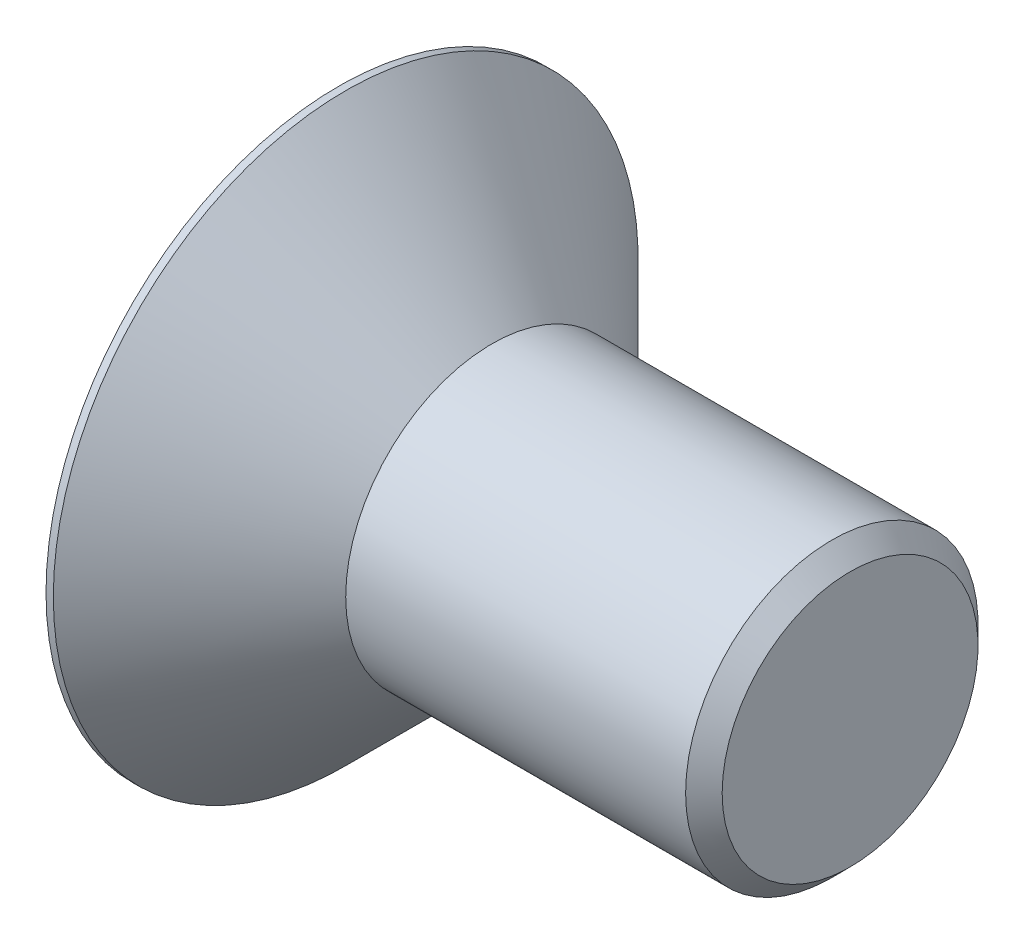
from build123d import *

# Parameters (mm, degrees)
FASE1_SIZE                      = 0.5
SCHNITT_LINEAR_AUSTRAGEN1_DEPTH = 2.5


with BuildPart() as part:
    # Skizze1 → Rotation1 (revolve)
    with BuildSketch(Plane.XY, mode=Mode.PRIVATE) as rotation1_sk:
        Polygon((0, 0), (0, 8), (0.2, 8), (4.2, 4), (14, 4), (14, 0), align=None)
    revolve(rotation1_sk.sketch.rotate(Axis((0, 0, 0), (1, 0, 0)), 90), axis=Axis((0, 0, 0), (1, 0, 0)))

    # Fase1
    fase1_edges = [part.edges().sort_by_distance(p)[0] for p in [
        (14, 0, -4),
    ]]
    chamfer(fase1_edges, length=FASE1_SIZE)

    # Skizze2 → Schnitt-Linear austragen1 (cut)
    with BuildSketch(Plane.ZY):
        Polygon((2.3377107, 1.693647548), (-0.297886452, 2.871340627), (-2.635597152, 1.177693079), (-2.3377107, -1.693647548), (0.297886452, -2.871340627), (2.635597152, -1.177693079), align=None)
    extrude(amount=-SCHNITT_LINEAR_AUSTRAGEN1_DEPTH, mode=Mode.SUBTRACT)


solid = part.part
